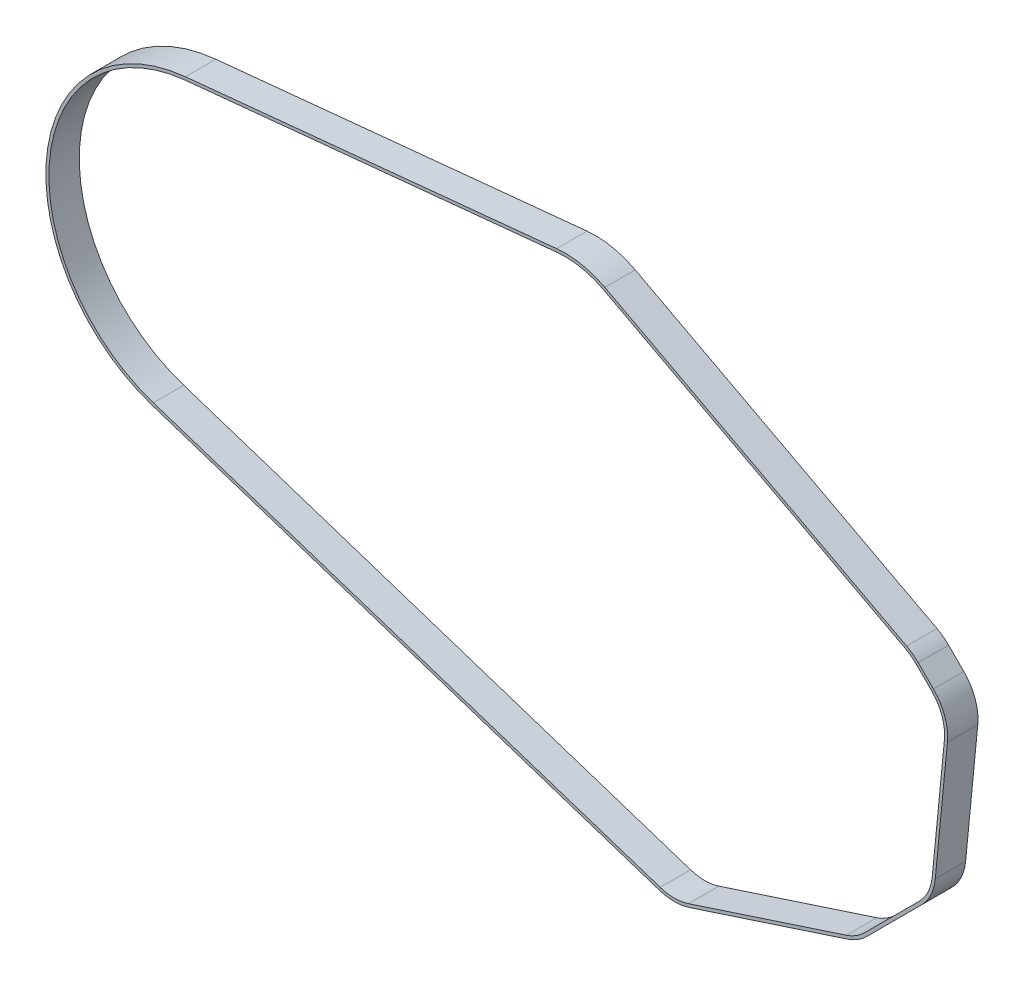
ISO-10303-21;
HEADER;
FILE_DESCRIPTION(('STEP AP214'),'2;1');
FILE_NAME('part.step','',(''),(''),'','','');
FILE_SCHEMA(('AUTOMOTIVE_DESIGN { 1 0 10303 214 1 1 1 1 }'));
ENDSEC;
DATA;
#1=APPLICATION_CONTEXT('core data for automotive mechanical design processes');
#2=APPLICATION_PROTOCOL_DEFINITION('international standard','automotive_design',2000,#1);
#3=PRODUCT_CONTEXT('',#1,'mechanical');
#4=PRODUCT('Part','Part','',(#3));
#5=PRODUCT_RELATED_PRODUCT_CATEGORY('part','',(#4));
#6=PRODUCT_DEFINITION_FORMATION('','',#4);
#7=PRODUCT_DEFINITION_CONTEXT('part definition',#1,'design');
#8=PRODUCT_DEFINITION('design','',#6,#7);
#9=PRODUCT_DEFINITION_SHAPE('','',#8);
#10=(LENGTH_UNIT() NAMED_UNIT(*) SI_UNIT(.MILLI.,.METRE.));
#11=(NAMED_UNIT(*) PLANE_ANGLE_UNIT() SI_UNIT($,.RADIAN.));
#12=(NAMED_UNIT(*) SI_UNIT($,.STERADIAN.) SOLID_ANGLE_UNIT());
#13=UNCERTAINTY_MEASURE_WITH_UNIT(LENGTH_MEASURE(1.E-05),#10,'distance_accuracy_value','');
#14=(GEOMETRIC_REPRESENTATION_CONTEXT(3) GLOBAL_UNCERTAINTY_ASSIGNED_CONTEXT((#13)) GLOBAL_UNIT_ASSIGNED_CONTEXT((#10,
#11,#12)) REPRESENTATION_CONTEXT('',''));
#15=CARTESIAN_POINT('',(0.,0.,0.));
#16=DIRECTION('',(0.,0.,1.));
#17=DIRECTION('',(1.,0.,0.));
#18=AXIS2_PLACEMENT_3D('',#15,#16,#17);
#19=CARTESIAN_POINT('',(0.,0.,-10.));
#20=DIRECTION('',(0.,0.,1.));
#21=DIRECTION('',(1.,0.,0.));
#22=AXIS2_PLACEMENT_3D('',#19,#20,#21);
#23=CYLINDRICAL_SURFACE('',#22,51.);
#24=CARTESIAN_POINT('',(0.,0.,0.));
#25=DIRECTION('',(0.,0.,1.));
#26=DIRECTION('',(1.,0.,0.));
#27=AXIS2_PLACEMENT_3D('',#24,#25,#26);
#28=CIRCLE('',#27,51.);
#29=CARTESIAN_POINT('',(-5.02754675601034,50.7515888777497,0.));
#30=VERTEX_POINT('',#29);
#31=CARTESIAN_POINT('',(-15.8941315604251,-48.4600514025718,0.));
#32=VERTEX_POINT('',#31);
#33=EDGE_CURVE('E311',#30,#32,#28,.T.);
#34=ORIENTED_EDGE('',*,*,#33,.F.);
#35=DIRECTION('',(0.,0.,1.));
#36=VECTOR('',#35,1.);
#37=CARTESIAN_POINT('',(-5.02754675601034,50.7515888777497,-10.));
#38=LINE('',#37,#36);
#39=CARTESIAN_POINT('',(-5.02754675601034,50.7515888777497,-10.));
#40=VERTEX_POINT('',#39);
#41=EDGE_CURVE('E11',#40,#30,#38,.T.);
#42=ORIENTED_EDGE('',*,*,#41,.F.);
#43=CARTESIAN_POINT('',(0.,0.,-10.));
#44=DIRECTION('',(0.,0.,1.));
#45=DIRECTION('',(1.,0.,0.));
#46=AXIS2_PLACEMENT_3D('',#43,#44,#45);
#47=CIRCLE('',#46,51.);
#48=CARTESIAN_POINT('',(-15.8941315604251,-48.4600514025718,-10.));
#49=VERTEX_POINT('',#48);
#50=EDGE_CURVE('E375',#40,#49,#47,.T.);
#51=ORIENTED_EDGE('',*,*,#50,.T.);
#52=DIRECTION('',(0.,0.,1.));
#53=VECTOR('',#52,1.);
#54=CARTESIAN_POINT('',(-15.8941315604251,-48.4600514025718,-10.));
#55=LINE('',#54,#53);
#56=EDGE_CURVE('E34',#49,#32,#55,.T.);
#57=ORIENTED_EDGE('',*,*,#56,.T.);
#58=EDGE_LOOP('',(#34,#42,#51,#57));
#59=FACE_BOUND('',#58,.T.);
#60=ADVANCED_FACE('F31',(#59),#23,.T.);
#61=CARTESIAN_POINT('',(-5.02754675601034,50.7515888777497,-10.));
#62=DIRECTION('',(-0.0985793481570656,0.995129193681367,0.));
#63=DIRECTION('',(-0.995129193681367,-0.0985793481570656,0.));
#64=AXIS2_PLACEMENT_3D('',#61,#62,#63);
#65=PLANE('',#64);
#66=DIRECTION('',(-0.995129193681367,-0.0985793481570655,0.));
#67=VECTOR('',#66,1.);
#68=CARTESIAN_POINT('',(-5.02754675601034,50.7515888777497,0.));
#69=LINE('',#68,#67);
#70=CARTESIAN_POINT('',(117.239778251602,62.8636174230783,0.));
#71=VERTEX_POINT('',#70);
#72=EDGE_CURVE('E372',#71,#30,#69,.T.);
#73=ORIENTED_EDGE('',*,*,#72,.F.);
#74=DIRECTION('',(0.,0.,1.));
#75=VECTOR('',#74,1.);
#76=CARTESIAN_POINT('',(117.239778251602,62.8636174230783,-10.));
#77=LINE('',#76,#75);
#78=CARTESIAN_POINT('',(117.239778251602,62.8636174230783,-10.));
#79=VERTEX_POINT('',#78);
#80=EDGE_CURVE('E39',#79,#71,#77,.T.);
#81=ORIENTED_EDGE('',*,*,#80,.F.);
#82=DIRECTION('',(-0.995129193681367,-0.0985793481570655,0.));
#83=VECTOR('',#82,1.);
#84=CARTESIAN_POINT('',(-5.02754675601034,50.7515888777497,-10.));
#85=LINE('',#84,#83);
#86=EDGE_CURVE('E414',#79,#40,#85,.T.);
#87=ORIENTED_EDGE('',*,*,#86,.T.);
#88=ORIENTED_EDGE('',*,*,#41,.T.);
#89=EDGE_LOOP('',(#73,#81,#87,#88));
#90=FACE_BOUND('',#89,.T.);
#91=ADVANCED_FACE('F449',(#90),#65,.T.);
#92=CARTESIAN_POINT('',(120.,35.,-10.));
#93=DIRECTION('',(0.,0.,1.));
#94=DIRECTION('',(1.,0.,0.));
#95=AXIS2_PLACEMENT_3D('',#92,#93,#94);
#96=CYLINDRICAL_SURFACE('',#95,28.);
#97=CARTESIAN_POINT('',(120.,35.,0.));
#98=DIRECTION('',(0.,0.,1.));
#99=DIRECTION('',(1.,0.,0.));
#100=AXIS2_PLACEMENT_3D('',#97,#98,#99);
#101=CIRCLE('',#100,28.);
#102=CARTESIAN_POINT('',(133.098849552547,59.7471238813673,0.));
#103=VERTEX_POINT('',#102);
#104=EDGE_CURVE('E369',#103,#71,#101,.T.);
#105=ORIENTED_EDGE('',*,*,#104,.F.);
#106=DIRECTION('',(0.,0.,1.));
#107=VECTOR('',#106,1.);
#108=CARTESIAN_POINT('',(133.098849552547,59.7471238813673,-10.));
#109=LINE('',#108,#107);
#110=CARTESIAN_POINT('',(133.098849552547,59.7471238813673,-10.));
#111=VERTEX_POINT('',#110);
#112=EDGE_CURVE('E418',#111,#103,#109,.T.);
#113=ORIENTED_EDGE('',*,*,#112,.F.);
#114=CARTESIAN_POINT('',(120.,35.,-10.));
#115=DIRECTION('',(0.,0.,1.));
#116=DIRECTION('',(1.,0.,0.));
#117=AXIS2_PLACEMENT_3D('',#114,#115,#116);
#118=CIRCLE('',#117,28.);
#119=EDGE_CURVE('E411',#111,#79,#118,.T.);
#120=ORIENTED_EDGE('',*,*,#119,.T.);
#121=ORIENTED_EDGE('',*,*,#80,.T.);
#122=EDGE_LOOP('',(#105,#113,#120,#121));
#123=FACE_BOUND('',#122,.T.);
#124=ADVANCED_FACE('F494',(#123),#96,.T.);
#125=CARTESIAN_POINT('',(133.098849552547,59.7471238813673,-10.));
#126=DIRECTION('',(0.467816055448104,0.883825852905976,0.));
#127=DIRECTION('',(-0.883825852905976,0.467816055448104,0.));
#128=AXIS2_PLACEMENT_3D('',#125,#126,#127);
#129=PLANE('',#128);
#130=DIRECTION('',(-0.883825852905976,0.467816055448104,0.));
#131=VECTOR('',#130,1.);
#132=CARTESIAN_POINT('',(133.098849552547,59.7471238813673,0.));
#133=LINE('',#132,#131);
#134=CARTESIAN_POINT('',(232.48505688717,7.14121364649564,0.));
#135=VERTEX_POINT('',#134);
#136=EDGE_CURVE('E366',#135,#103,#133,.T.);
#137=ORIENTED_EDGE('',*,*,#136,.F.);
#138=DIRECTION('',(0.,0.,1.));
#139=VECTOR('',#138,1.);
#140=CARTESIAN_POINT('',(232.48505688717,7.14121364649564,-10.));
#141=LINE('',#140,#139);
#142=CARTESIAN_POINT('',(232.48505688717,7.14121364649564,-10.));
#143=VERTEX_POINT('',#142);
#144=EDGE_CURVE('E420',#143,#135,#141,.T.);
#145=ORIENTED_EDGE('',*,*,#144,.F.);
#146=DIRECTION('',(-0.883825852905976,0.467816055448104,0.));
#147=VECTOR('',#146,1.);
#148=CARTESIAN_POINT('',(133.098849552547,59.7471238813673,-10.));
#149=LINE('',#148,#147);
#150=EDGE_CURVE('E408',#143,#111,#149,.T.);
#151=ORIENTED_EDGE('',*,*,#150,.T.);
#152=ORIENTED_EDGE('',*,*,#112,.T.);
#153=EDGE_LOOP('',(#137,#145,#151,#152));
#154=FACE_BOUND('',#153,.T.);
#155=ADVANCED_FACE('F492',(#154),#129,.T.);
#156=CARTESIAN_POINT('',(225.,-7.,-10.));
#157=DIRECTION('',(0.,0.,1.));
#158=DIRECTION('',(1.,0.,0.));
#159=AXIS2_PLACEMENT_3D('',#156,#157,#158);
#160=CYLINDRICAL_SURFACE('',#159,16.);
#161=CARTESIAN_POINT('',(225.,-7.,0.));
#162=DIRECTION('',(0.,0.,1.));
#163=DIRECTION('',(1.,0.,0.));
#164=AXIS2_PLACEMENT_3D('',#161,#162,#163);
#165=CIRCLE('',#164,16.);
#166=CARTESIAN_POINT('',(236.313708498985,4.31370849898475,0.));
#167=VERTEX_POINT('',#166);
#168=EDGE_CURVE('E363',#167,#135,#165,.T.);
#169=ORIENTED_EDGE('',*,*,#168,.F.);
#170=DIRECTION('',(0.,0.,1.));
#171=VECTOR('',#170,1.);
#172=CARTESIAN_POINT('',(236.313708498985,4.31370849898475,-10.));
#173=LINE('',#172,#171);
#174=CARTESIAN_POINT('',(236.313708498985,4.31370849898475,-10.));
#175=VERTEX_POINT('',#174);
#176=EDGE_CURVE('E422',#175,#167,#173,.T.);
#177=ORIENTED_EDGE('',*,*,#176,.F.);
#178=CARTESIAN_POINT('',(225.,-7.,-10.));
#179=DIRECTION('',(0.,0.,1.));
#180=DIRECTION('',(1.,0.,0.));
#181=AXIS2_PLACEMENT_3D('',#178,#179,#180);
#182=CIRCLE('',#181,16.);
#183=EDGE_CURVE('E405',#175,#143,#182,.T.);
#184=ORIENTED_EDGE('',*,*,#183,.T.);
#185=ORIENTED_EDGE('',*,*,#144,.T.);
#186=EDGE_LOOP('',(#169,#177,#184,#185));
#187=FACE_BOUND('',#186,.T.);
#188=ADVANCED_FACE('F488',(#187),#160,.T.);
#189=CARTESIAN_POINT('',(236.313708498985,4.31370849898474,-10.));
#190=DIRECTION('',(0.707106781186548,0.707106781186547,0.));
#191=DIRECTION('',(-0.707106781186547,0.707106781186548,0.));
#192=AXIS2_PLACEMENT_3D('',#189,#190,#191);
#193=PLANE('',#192);
#194=DIRECTION('',(-0.707106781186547,0.707106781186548,0.));
#195=VECTOR('',#194,1.);
#196=CARTESIAN_POINT('',(236.313708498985,4.31370849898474,0.));
#197=LINE('',#196,#195);
#198=CARTESIAN_POINT('',(241.313708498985,-0.686291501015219,0.));
#199=VERTEX_POINT('',#198);
#200=EDGE_CURVE('E360',#199,#167,#197,.T.);
#201=ORIENTED_EDGE('',*,*,#200,.F.);
#202=DIRECTION('',(0.,0.,1.));
#203=VECTOR('',#202,1.);
#204=CARTESIAN_POINT('',(241.313708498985,-0.686291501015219,-10.));
#205=LINE('',#204,#203);
#206=CARTESIAN_POINT('',(241.313708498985,-0.686291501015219,-10.));
#207=VERTEX_POINT('',#206);
#208=EDGE_CURVE('E424',#207,#199,#205,.T.);
#209=ORIENTED_EDGE('',*,*,#208,.F.);
#210=DIRECTION('',(-0.707106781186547,0.707106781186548,0.));
#211=VECTOR('',#210,1.);
#212=CARTESIAN_POINT('',(236.313708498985,4.31370849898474,-10.));
#213=LINE('',#212,#211);
#214=EDGE_CURVE('E402',#207,#175,#213,.T.);
#215=ORIENTED_EDGE('',*,*,#214,.T.);
#216=ORIENTED_EDGE('',*,*,#176,.T.);
#217=EDGE_LOOP('',(#201,#209,#215,#216));
#218=FACE_BOUND('',#217,.T.);
#219=ADVANCED_FACE('F484',(#218),#193,.T.);
#220=CARTESIAN_POINT('',(230.,-12.,-10.));
#221=DIRECTION('',(0.,0.,1.));
#222=DIRECTION('',(1.,0.,0.));
#223=AXIS2_PLACEMENT_3D('',#220,#221,#222);
#224=CYLINDRICAL_SURFACE('',#223,16.);
#225=CARTESIAN_POINT('',(230.,-12.,0.));
#226=DIRECTION('',(0.,0.,1.));
#227=DIRECTION('',(1.,0.,0.));
#228=AXIS2_PLACEMENT_3D('',#225,#226,#227);
#229=CIRCLE('',#228,16.);
#230=CARTESIAN_POINT('',(245.92439414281,-13.5535994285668,0.));
#231=VERTEX_POINT('',#230);
#232=EDGE_CURVE('E357',#231,#199,#229,.T.);
#233=ORIENTED_EDGE('',*,*,#232,.F.);
#234=DIRECTION('',(0.,0.,1.));
#235=VECTOR('',#234,1.);
#236=CARTESIAN_POINT('',(245.92439414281,-13.5535994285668,-10.));
#237=LINE('',#236,#235);
#238=CARTESIAN_POINT('',(245.92439414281,-13.5535994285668,-10.));
#239=VERTEX_POINT('',#238);
#240=EDGE_CURVE('E426',#239,#231,#237,.T.);
#241=ORIENTED_EDGE('',*,*,#240,.F.);
#242=CARTESIAN_POINT('',(230.,-12.,-10.));
#243=DIRECTION('',(0.,0.,1.));
#244=DIRECTION('',(1.,0.,0.));
#245=AXIS2_PLACEMENT_3D('',#242,#243,#244);
#246=CIRCLE('',#245,16.);
#247=EDGE_CURVE('E399',#239,#207,#246,.T.);
#248=ORIENTED_EDGE('',*,*,#247,.T.);
#249=ORIENTED_EDGE('',*,*,#208,.T.);
#250=EDGE_LOOP('',(#233,#241,#248,#249));
#251=FACE_BOUND('',#250,.T.);
#252=ADVANCED_FACE('F480',(#251),#224,.T.);
#253=CARTESIAN_POINT('',(245.92439414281,-13.5535994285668,-10.));
#254=DIRECTION('',(0.995274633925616,-0.0970999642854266,0.));
#255=DIRECTION('',(0.0970999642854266,0.995274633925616,0.));
#256=AXIS2_PLACEMENT_3D('',#253,#254,#255);
#257=PLANE('',#256);
#258=DIRECTION('',(0.0970999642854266,0.995274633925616,0.));
#259=VECTOR('',#258,1.);
#260=CARTESIAN_POINT('',(245.92439414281,-13.5535994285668,0.));
#261=LINE('',#260,#259);
#262=CARTESIAN_POINT('',(241.92439414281,-54.5535994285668,0.));
#263=VERTEX_POINT('',#262);
#264=EDGE_CURVE('E354',#263,#231,#261,.T.);
#265=ORIENTED_EDGE('',*,*,#264,.F.);
#266=DIRECTION('',(0.,0.,1.));
#267=VECTOR('',#266,1.);
#268=CARTESIAN_POINT('',(241.92439414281,-54.5535994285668,-10.));
#269=LINE('',#268,#267);
#270=CARTESIAN_POINT('',(241.92439414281,-54.5535994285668,-10.));
#271=VERTEX_POINT('',#270);
#272=EDGE_CURVE('E428',#271,#263,#269,.T.);
#273=ORIENTED_EDGE('',*,*,#272,.F.);
#274=DIRECTION('',(0.0970999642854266,0.995274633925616,0.));
#275=VECTOR('',#274,1.);
#276=CARTESIAN_POINT('',(245.92439414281,-13.5535994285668,-10.));
#277=LINE('',#276,#275);
#278=EDGE_CURVE('E396',#271,#239,#277,.T.);
#279=ORIENTED_EDGE('',*,*,#278,.T.);
#280=ORIENTED_EDGE('',*,*,#240,.T.);
#281=EDGE_LOOP('',(#265,#273,#279,#280));
#282=FACE_BOUND('',#281,.T.);
#283=ADVANCED_FACE('F476',(#282),#257,.T.);
#284=CARTESIAN_POINT('',(226.,-53.,-10.));
#285=DIRECTION('',(0.,0.,1.));
#286=DIRECTION('',(1.,0.,0.));
#287=AXIS2_PLACEMENT_3D('',#284,#285,#286);
#288=CYLINDRICAL_SURFACE('',#287,16.);
#289=CARTESIAN_POINT('',(226.,-53.,0.));
#290=DIRECTION('',(0.,0.,1.));
#291=DIRECTION('',(1.,0.,0.));
#292=AXIS2_PLACEMENT_3D('',#289,#290,#291);
#293=CIRCLE('',#292,16.);
#294=CARTESIAN_POINT('',(237.313708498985,-64.3137084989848,0.));
#295=VERTEX_POINT('',#294);
#296=EDGE_CURVE('E351',#295,#263,#293,.T.);
#297=ORIENTED_EDGE('',*,*,#296,.F.);
#298=DIRECTION('',(0.,0.,1.));
#299=VECTOR('',#298,1.);
#300=CARTESIAN_POINT('',(237.313708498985,-64.3137084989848,-10.));
#301=LINE('',#300,#299);
#302=CARTESIAN_POINT('',(237.313708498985,-64.3137084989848,-10.));
#303=VERTEX_POINT('',#302);
#304=EDGE_CURVE('E430',#303,#295,#301,.T.);
#305=ORIENTED_EDGE('',*,*,#304,.F.);
#306=CARTESIAN_POINT('',(226.,-53.,-10.));
#307=DIRECTION('',(0.,0.,1.));
#308=DIRECTION('',(1.,0.,0.));
#309=AXIS2_PLACEMENT_3D('',#306,#307,#308);
#310=CIRCLE('',#309,16.);
#311=EDGE_CURVE('E393',#303,#271,#310,.T.);
#312=ORIENTED_EDGE('',*,*,#311,.T.);
#313=ORIENTED_EDGE('',*,*,#272,.T.);
#314=EDGE_LOOP('',(#297,#305,#312,#313));
#315=FACE_BOUND('',#314,.T.);
#316=ADVANCED_FACE('F472',(#315),#288,.T.);
#317=CARTESIAN_POINT('',(237.313708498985,-64.3137084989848,-10.));
#318=DIRECTION('',(0.707106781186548,-0.707106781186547,0.));
#319=DIRECTION('',(0.707106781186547,0.707106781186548,0.));
#320=AXIS2_PLACEMENT_3D('',#317,#318,#319);
#321=PLANE('',#320);
#322=DIRECTION('',(0.707106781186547,0.707106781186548,0.));
#323=VECTOR('',#322,1.);
#324=CARTESIAN_POINT('',(237.313708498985,-64.3137084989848,0.));
#325=LINE('',#324,#323);
#326=CARTESIAN_POINT('',(219.313708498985,-82.3137084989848,0.));
#327=VERTEX_POINT('',#326);
#328=EDGE_CURVE('E348',#327,#295,#325,.T.);
#329=ORIENTED_EDGE('',*,*,#328,.F.);
#330=DIRECTION('',(0.,0.,1.));
#331=VECTOR('',#330,1.);
#332=CARTESIAN_POINT('',(219.313708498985,-82.3137084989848,-10.));
#333=LINE('',#332,#331);
#334=CARTESIAN_POINT('',(219.313708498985,-82.3137084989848,-10.));
#335=VERTEX_POINT('',#334);
#336=EDGE_CURVE('E432',#335,#327,#333,.T.);
#337=ORIENTED_EDGE('',*,*,#336,.F.);
#338=DIRECTION('',(0.707106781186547,0.707106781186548,0.));
#339=VECTOR('',#338,1.);
#340=CARTESIAN_POINT('',(237.313708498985,-64.3137084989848,-10.));
#341=LINE('',#340,#339);
#342=EDGE_CURVE('E390',#335,#303,#341,.T.);
#343=ORIENTED_EDGE('',*,*,#342,.T.);
#344=ORIENTED_EDGE('',*,*,#304,.T.);
#345=EDGE_LOOP('',(#329,#337,#343,#344));
#346=FACE_BOUND('',#345,.T.);
#347=ADVANCED_FACE('F468',(#346),#321,.T.);
#348=CARTESIAN_POINT('',(208.,-71.,-10.));
#349=DIRECTION('',(0.,0.,1.));
#350=DIRECTION('',(1.,0.,0.));
#351=AXIS2_PLACEMENT_3D('',#348,#349,#350);
#352=CYLINDRICAL_SURFACE('',#351,16.);
#353=CARTESIAN_POINT('',(208.,-71.,0.));
#354=DIRECTION('',(0.,0.,1.));
#355=DIRECTION('',(1.,0.,0.));
#356=AXIS2_PLACEMENT_3D('',#353,#354,#355);
#357=CIRCLE('',#356,16.);
#358=CARTESIAN_POINT('',(212.971821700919,-86.2079252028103,0.));
#359=VERTEX_POINT('',#358);
#360=EDGE_CURVE('E345',#359,#327,#357,.T.);
#361=ORIENTED_EDGE('',*,*,#360,.F.);
#362=DIRECTION('',(0.,0.,1.));
#363=VECTOR('',#362,1.);
#364=CARTESIAN_POINT('',(212.971821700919,-86.2079252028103,-10.));
#365=LINE('',#364,#363);
#366=CARTESIAN_POINT('',(212.971821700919,-86.2079252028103,-10.));
#367=VERTEX_POINT('',#366);
#368=EDGE_CURVE('E434',#367,#359,#365,.T.);
#369=ORIENTED_EDGE('',*,*,#368,.F.);
#370=CARTESIAN_POINT('',(208.,-71.,-10.));
#371=DIRECTION('',(0.,0.,1.));
#372=DIRECTION('',(1.,0.,0.));
#373=AXIS2_PLACEMENT_3D('',#370,#371,#372);
#374=CIRCLE('',#373,16.);
#375=EDGE_CURVE('E387',#367,#335,#374,.T.);
#376=ORIENTED_EDGE('',*,*,#375,.T.);
#377=ORIENTED_EDGE('',*,*,#336,.T.);
#378=EDGE_LOOP('',(#361,#369,#376,#377));
#379=FACE_BOUND('',#378,.T.);
#380=ADVANCED_FACE('F464',(#379),#352,.T.);
#381=CARTESIAN_POINT('',(212.971821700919,-86.2079252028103,-10.));
#382=DIRECTION('',(0.310738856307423,-0.950495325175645,0.));
#383=DIRECTION('',(0.950495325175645,0.310738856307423,0.));
#384=AXIS2_PLACEMENT_3D('',#381,#382,#383);
#385=PLANE('',#384);
#386=DIRECTION('',(0.950495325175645,0.310738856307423,0.));
#387=VECTOR('',#386,1.);
#388=CARTESIAN_POINT('',(212.971821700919,-86.2079252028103,0.));
#389=LINE('',#388,#387);
#390=CARTESIAN_POINT('',(160.971821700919,-103.20792520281,0.));
#391=VERTEX_POINT('',#390);
#392=EDGE_CURVE('E342',#391,#359,#389,.T.);
#393=ORIENTED_EDGE('',*,*,#392,.F.);
#394=DIRECTION('',(0.,0.,1.));
#395=VECTOR('',#394,1.);
#396=CARTESIAN_POINT('',(160.971821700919,-103.20792520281,-10.));
#397=LINE('',#396,#395);
#398=CARTESIAN_POINT('',(160.971821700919,-103.20792520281,-10.));
#399=VERTEX_POINT('',#398);
#400=EDGE_CURVE('E436',#399,#391,#397,.T.);
#401=ORIENTED_EDGE('',*,*,#400,.F.);
#402=DIRECTION('',(0.950495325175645,0.310738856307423,0.));
#403=VECTOR('',#402,1.);
#404=CARTESIAN_POINT('',(212.971821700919,-86.2079252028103,-10.));
#405=LINE('',#404,#403);
#406=EDGE_CURVE('E384',#399,#367,#405,.T.);
#407=ORIENTED_EDGE('',*,*,#406,.T.);
#408=ORIENTED_EDGE('',*,*,#368,.T.);
#409=EDGE_LOOP('',(#393,#401,#407,#408));
#410=FACE_BOUND('',#409,.T.);
#411=ADVANCED_FACE('F462',(#410),#385,.T.);
#412=CARTESIAN_POINT('',(156.,-88.,-10.));
#413=DIRECTION('',(0.,0.,1.));
#414=DIRECTION('',(1.,0.,0.));
#415=AXIS2_PLACEMENT_3D('',#412,#413,#414);
#416=CYLINDRICAL_SURFACE('',#415,16.);
#417=CARTESIAN_POINT('',(156.,-88.,0.));
#418=DIRECTION('',(0.,0.,1.));
#419=DIRECTION('',(1.,0.,0.));
#420=AXIS2_PLACEMENT_3D('',#417,#418,#419);
#421=CIRCLE('',#420,16.);
#422=CARTESIAN_POINT('',(151.013605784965,-103.203153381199,0.));
#423=VERTEX_POINT('',#422);
#424=EDGE_CURVE('E339',#423,#391,#421,.T.);
#425=ORIENTED_EDGE('',*,*,#424,.F.);
#426=DIRECTION('',(0.,0.,1.));
#427=VECTOR('',#426,1.);
#428=CARTESIAN_POINT('',(151.013605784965,-103.203153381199,-10.));
#429=LINE('',#428,#427);
#430=CARTESIAN_POINT('',(151.013605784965,-103.203153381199,-10.));
#431=VERTEX_POINT('',#430);
#432=EDGE_CURVE('E437',#431,#423,#429,.T.);
#433=ORIENTED_EDGE('',*,*,#432,.F.);
#434=CARTESIAN_POINT('',(156.,-88.,-10.));
#435=DIRECTION('',(0.,0.,1.));
#436=DIRECTION('',(1.,0.,0.));
#437=AXIS2_PLACEMENT_3D('',#434,#435,#436);
#438=CIRCLE('',#437,16.);
#439=EDGE_CURVE('E381',#431,#399,#438,.T.);
#440=ORIENTED_EDGE('',*,*,#439,.T.);
#441=ORIENTED_EDGE('',*,*,#400,.T.);
#442=EDGE_LOOP('',(#425,#433,#440,#441));
#443=FACE_BOUND('',#442,.T.);
#444=ADVANCED_FACE('F458',(#443),#416,.T.);
#445=CARTESIAN_POINT('',(151.013605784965,-103.203153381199,-10.));
#446=DIRECTION('',(-0.311649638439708,-0.950197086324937,0.));
#447=DIRECTION('',(0.950197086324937,-0.311649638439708,0.));
#448=AXIS2_PLACEMENT_3D('',#445,#446,#447);
#449=PLANE('',#448);
#450=DIRECTION('',(0.950197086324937,-0.311649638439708,0.));
#451=VECTOR('',#450,1.);
#452=CARTESIAN_POINT('',(151.013605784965,-103.203153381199,0.));
#453=LINE('',#452,#451);
#454=EDGE_CURVE('E336',#32,#423,#453,.T.);
#455=ORIENTED_EDGE('',*,*,#454,.F.);
#456=ORIENTED_EDGE('',*,*,#56,.F.);
#457=DIRECTION('',(0.950197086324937,-0.311649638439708,0.));
#458=VECTOR('',#457,1.);
#459=CARTESIAN_POINT('',(151.013605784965,-103.203153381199,-10.));
#460=LINE('',#459,#458);
#461=EDGE_CURVE('E378',#49,#431,#460,.T.);
#462=ORIENTED_EDGE('',*,*,#461,.T.);
#463=ORIENTED_EDGE('',*,*,#432,.T.);
#464=EDGE_LOOP('',(#455,#456,#462,#463));
#465=FACE_BOUND('',#464,.T.);
#466=ADVANCED_FACE('F445',(#465),#449,.T.);
#467=CARTESIAN_POINT('',(0.,0.,-10.));
#468=DIRECTION('',(0.,0.,1.));
#469=DIRECTION('',(1.,0.,0.));
#470=AXIS2_PLACEMENT_3D('',#467,#468,#469);
#471=PLANE('',#470);
#472=DIRECTION('',(-0.995129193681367,-0.0985793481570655,0.));
#473=VECTOR('',#472,1.);
#474=CARTESIAN_POINT('',(-4.92896740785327,49.7564596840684,-10.));
#475=LINE('',#474,#473);
#476=CARTESIAN_POINT('',(117.338357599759,61.8684882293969,-10.));
#477=VERTEX_POINT('',#476);
#478=CARTESIAN_POINT('',(-4.92896740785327,49.7564596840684,-10.));
#479=VERTEX_POINT('',#478);
#480=EDGE_CURVE('E306',#477,#479,#475,.T.);
#481=ORIENTED_EDGE('',*,*,#480,.T.);
#482=CARTESIAN_POINT('',(0.,0.,-10.));
#483=DIRECTION('',(0.,0.,1.));
#484=DIRECTION('',(1.,0.,0.));
#485=AXIS2_PLACEMENT_3D('',#482,#483,#484);
#486=CIRCLE('',#485,50.);
#487=CARTESIAN_POINT('',(-15.5824819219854,-47.5098543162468,-10.));
#488=VERTEX_POINT('',#487);
#489=EDGE_CURVE('E270',#479,#488,#486,.T.);
#490=ORIENTED_EDGE('',*,*,#489,.T.);
#491=DIRECTION('',(0.950197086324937,-0.311649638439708,0.));
#492=VECTOR('',#491,1.);
#493=CARTESIAN_POINT('',(151.325255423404,-102.252956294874,-10.));
#494=LINE('',#493,#492);
#495=CARTESIAN_POINT('',(151.325255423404,-102.252956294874,-10.));
#496=VERTEX_POINT('',#495);
#497=EDGE_CURVE('E273',#488,#496,#494,.T.);
#498=ORIENTED_EDGE('',*,*,#497,.T.);
#499=CARTESIAN_POINT('',(156.,-88.,-10.));
#500=DIRECTION('',(0.,0.,1.));
#501=DIRECTION('',(1.,0.,0.));
#502=AXIS2_PLACEMENT_3D('',#499,#500,#501);
#503=CIRCLE('',#502,15.);
#504=CARTESIAN_POINT('',(160.661082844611,-102.257429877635,-10.));
#505=VERTEX_POINT('',#504);
#506=EDGE_CURVE('E47',#496,#505,#503,.T.);
#507=ORIENTED_EDGE('',*,*,#506,.T.);
#508=DIRECTION('',(0.950495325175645,0.310738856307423,0.));
#509=VECTOR('',#508,1.);
#510=CARTESIAN_POINT('',(212.661082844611,-85.2574298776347,-10.));
#511=LINE('',#510,#509);
#512=CARTESIAN_POINT('',(212.661082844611,-85.2574298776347,-10.));
#513=VERTEX_POINT('',#512);
#514=EDGE_CURVE('E276',#505,#513,#511,.T.);
#515=ORIENTED_EDGE('',*,*,#514,.T.);
#516=CARTESIAN_POINT('',(208.,-71.,-10.));
#517=DIRECTION('',(0.,0.,1.));
#518=DIRECTION('',(1.,0.,0.));
#519=AXIS2_PLACEMENT_3D('',#516,#517,#518);
#520=CIRCLE('',#519,15.);
#521=CARTESIAN_POINT('',(218.606601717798,-81.6066017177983,-10.));
#522=VERTEX_POINT('',#521);
#523=EDGE_CURVE('E279',#513,#522,#520,.T.);
#524=ORIENTED_EDGE('',*,*,#523,.T.);
#525=DIRECTION('',(0.707106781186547,0.707106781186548,0.));
#526=VECTOR('',#525,1.);
#527=CARTESIAN_POINT('',(236.606601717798,-63.6066017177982,-10.));
#528=LINE('',#527,#526);
#529=CARTESIAN_POINT('',(236.606601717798,-63.6066017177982,-10.));
#530=VERTEX_POINT('',#529);
#531=EDGE_CURVE('E282',#522,#530,#528,.T.);
#532=ORIENTED_EDGE('',*,*,#531,.T.);
#533=CARTESIAN_POINT('',(226.,-53.,-10.));
#534=DIRECTION('',(0.,0.,1.));
#535=DIRECTION('',(1.,0.,0.));
#536=AXIS2_PLACEMENT_3D('',#533,#534,#535);
#537=CIRCLE('',#536,15.);
#538=CARTESIAN_POINT('',(240.929119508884,-54.4564994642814,-10.));
#539=VERTEX_POINT('',#538);
#540=EDGE_CURVE('E285',#530,#539,#537,.T.);
#541=ORIENTED_EDGE('',*,*,#540,.T.);
#542=DIRECTION('',(0.0970999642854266,0.995274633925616,0.));
#543=VECTOR('',#542,1.);
#544=CARTESIAN_POINT('',(244.929119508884,-13.4564994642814,-10.));
#545=LINE('',#544,#543);
#546=CARTESIAN_POINT('',(244.929119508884,-13.4564994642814,-10.));
#547=VERTEX_POINT('',#546);
#548=EDGE_CURVE('E288',#539,#547,#545,.T.);
#549=ORIENTED_EDGE('',*,*,#548,.T.);
#550=CARTESIAN_POINT('',(230.,-12.,-10.));
#551=DIRECTION('',(0.,0.,1.));
#552=DIRECTION('',(1.,0.,0.));
#553=AXIS2_PLACEMENT_3D('',#550,#551,#552);
#554=CIRCLE('',#553,15.);
#555=CARTESIAN_POINT('',(240.606601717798,-1.39339828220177,-10.));
#556=VERTEX_POINT('',#555);
#557=EDGE_CURVE('E291',#547,#556,#554,.T.);
#558=ORIENTED_EDGE('',*,*,#557,.T.);
#559=DIRECTION('',(-0.707106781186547,0.707106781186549,0.));
#560=VECTOR('',#559,1.);
#561=CARTESIAN_POINT('',(235.606601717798,3.60660171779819,-10.));
#562=LINE('',#561,#560);
#563=CARTESIAN_POINT('',(235.606601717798,3.6066017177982,-10.));
#564=VERTEX_POINT('',#563);
#565=EDGE_CURVE('E294',#556,#564,#562,.T.);
#566=ORIENTED_EDGE('',*,*,#565,.T.);
#567=CARTESIAN_POINT('',(225.,-7.,-10.));
#568=DIRECTION('',(0.,0.,1.));
#569=DIRECTION('',(1.,0.,0.));
#570=AXIS2_PLACEMENT_3D('',#567,#568,#569);
#571=CIRCLE('',#570,15.);
#572=CARTESIAN_POINT('',(232.017240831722,6.25738779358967,-10.));
#573=VERTEX_POINT('',#572);
#574=EDGE_CURVE('E297',#564,#573,#571,.T.);
#575=ORIENTED_EDGE('',*,*,#574,.T.);
#576=DIRECTION('',(-0.883825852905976,0.467816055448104,0.));
#577=VECTOR('',#576,1.);
#578=CARTESIAN_POINT('',(132.631033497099,58.8632980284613,-10.));
#579=LINE('',#578,#577);
#580=CARTESIAN_POINT('',(132.631033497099,58.8632980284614,-10.));
#581=VERTEX_POINT('',#580);
#582=EDGE_CURVE('E300',#573,#581,#579,.T.);
#583=ORIENTED_EDGE('',*,*,#582,.T.);
#584=CARTESIAN_POINT('',(120.,35.,-10.));
#585=DIRECTION('',(0.,0.,1.));
#586=DIRECTION('',(1.,0.,0.));
#587=AXIS2_PLACEMENT_3D('',#584,#585,#586);
#588=CIRCLE('',#587,27.);
#589=EDGE_CURVE('E303',#581,#477,#588,.T.);
#590=ORIENTED_EDGE('',*,*,#589,.T.);
#591=EDGE_LOOP('',(#481,#490,#498,#507,#515,#524,#532,#541,#549,#558,#566,#575,#583,#590));
#592=FACE_BOUND('',#591,.T.);
#593=ORIENTED_EDGE('',*,*,#50,.F.);
#594=ORIENTED_EDGE('',*,*,#86,.F.);
#595=ORIENTED_EDGE('',*,*,#119,.F.);
#596=ORIENTED_EDGE('',*,*,#150,.F.);
#597=ORIENTED_EDGE('',*,*,#183,.F.);
#598=ORIENTED_EDGE('',*,*,#214,.F.);
#599=ORIENTED_EDGE('',*,*,#247,.F.);
#600=ORIENTED_EDGE('',*,*,#278,.F.);
#601=ORIENTED_EDGE('',*,*,#311,.F.);
#602=ORIENTED_EDGE('',*,*,#342,.F.);
#603=ORIENTED_EDGE('',*,*,#375,.F.);
#604=ORIENTED_EDGE('',*,*,#406,.F.);
#605=ORIENTED_EDGE('',*,*,#439,.F.);
#606=ORIENTED_EDGE('',*,*,#461,.F.);
#607=EDGE_LOOP('',(#593,#594,#595,#596,#597,#598,#599,#600,#601,#602,#603,#604,#605,#606));
#608=FACE_BOUND('',#607,.T.);
#609=ADVANCED_FACE('F452',(#592,#608),#471,.F.);
#610=CARTESIAN_POINT('',(0.,0.,0.));
#611=DIRECTION('',(0.,0.,1.));
#612=DIRECTION('',(1.,0.,0.));
#613=AXIS2_PLACEMENT_3D('',#610,#611,#612);
#614=PLANE('',#613);
#615=CARTESIAN_POINT('',(0.,0.,0.));
#616=DIRECTION('',(0.,0.,1.));
#617=DIRECTION('',(1.,0.,0.));
#618=AXIS2_PLACEMENT_3D('',#615,#616,#617);
#619=CIRCLE('',#618,50.);
#620=CARTESIAN_POINT('',(-4.92896740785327,49.7564596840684,0.));
#621=VERTEX_POINT('',#620);
#622=CARTESIAN_POINT('',(-15.5824819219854,-47.5098543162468,0.));
#623=VERTEX_POINT('',#622);
#624=EDGE_CURVE('E55',#621,#623,#619,.T.);
#625=ORIENTED_EDGE('',*,*,#624,.F.);
#626=DIRECTION('',(-0.995129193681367,-0.0985793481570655,0.));
#627=VECTOR('',#626,1.);
#628=CARTESIAN_POINT('',(-4.92896740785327,49.7564596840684,0.));
#629=LINE('',#628,#627);
#630=CARTESIAN_POINT('',(117.338357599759,61.8684882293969,0.));
#631=VERTEX_POINT('',#630);
#632=EDGE_CURVE('E267',#631,#621,#629,.T.);
#633=ORIENTED_EDGE('',*,*,#632,.F.);
#634=CARTESIAN_POINT('',(120.,35.,0.));
#635=DIRECTION('',(0.,0.,1.));
#636=DIRECTION('',(1.,0.,0.));
#637=AXIS2_PLACEMENT_3D('',#634,#635,#636);
#638=CIRCLE('',#637,27.);
#639=CARTESIAN_POINT('',(132.631033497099,58.8632980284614,0.));
#640=VERTEX_POINT('',#639);
#641=EDGE_CURVE('E264',#640,#631,#638,.T.);
#642=ORIENTED_EDGE('',*,*,#641,.F.);
#643=DIRECTION('',(-0.883825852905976,0.467816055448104,0.));
#644=VECTOR('',#643,1.);
#645=CARTESIAN_POINT('',(132.631033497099,58.8632980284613,0.));
#646=LINE('',#645,#644);
#647=CARTESIAN_POINT('',(232.017240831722,6.25738779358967,0.));
#648=VERTEX_POINT('',#647);
#649=EDGE_CURVE('E261',#648,#640,#646,.T.);
#650=ORIENTED_EDGE('',*,*,#649,.F.);
#651=CARTESIAN_POINT('',(225.,-7.,0.));
#652=DIRECTION('',(0.,0.,1.));
#653=DIRECTION('',(1.,0.,0.));
#654=AXIS2_PLACEMENT_3D('',#651,#652,#653);
#655=CIRCLE('',#654,15.);
#656=CARTESIAN_POINT('',(235.606601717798,3.6066017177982,0.));
#657=VERTEX_POINT('',#656);
#658=EDGE_CURVE('E258',#657,#648,#655,.T.);
#659=ORIENTED_EDGE('',*,*,#658,.F.);
#660=DIRECTION('',(-0.707106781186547,0.707106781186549,0.));
#661=VECTOR('',#660,1.);
#662=CARTESIAN_POINT('',(235.606601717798,3.60660171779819,0.));
#663=LINE('',#662,#661);
#664=CARTESIAN_POINT('',(240.606601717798,-1.39339828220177,0.));
#665=VERTEX_POINT('',#664);
#666=EDGE_CURVE('E255',#665,#657,#663,.T.);
#667=ORIENTED_EDGE('',*,*,#666,.F.);
#668=CARTESIAN_POINT('',(230.,-12.,0.));
#669=DIRECTION('',(0.,0.,1.));
#670=DIRECTION('',(1.,0.,0.));
#671=AXIS2_PLACEMENT_3D('',#668,#669,#670);
#672=CIRCLE('',#671,15.);
#673=CARTESIAN_POINT('',(244.929119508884,-13.4564994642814,0.));
#674=VERTEX_POINT('',#673);
#675=EDGE_CURVE('E252',#674,#665,#672,.T.);
#676=ORIENTED_EDGE('',*,*,#675,.F.);
#677=DIRECTION('',(0.0970999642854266,0.995274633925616,0.));
#678=VECTOR('',#677,1.);
#679=CARTESIAN_POINT('',(244.929119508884,-13.4564994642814,0.));
#680=LINE('',#679,#678);
#681=CARTESIAN_POINT('',(240.929119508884,-54.4564994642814,0.));
#682=VERTEX_POINT('',#681);
#683=EDGE_CURVE('E249',#682,#674,#680,.T.);
#684=ORIENTED_EDGE('',*,*,#683,.F.);
#685=CARTESIAN_POINT('',(226.,-53.,0.));
#686=DIRECTION('',(0.,0.,1.));
#687=DIRECTION('',(1.,0.,0.));
#688=AXIS2_PLACEMENT_3D('',#685,#686,#687);
#689=CIRCLE('',#688,15.);
#690=CARTESIAN_POINT('',(236.606601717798,-63.6066017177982,0.));
#691=VERTEX_POINT('',#690);
#692=EDGE_CURVE('E246',#691,#682,#689,.T.);
#693=ORIENTED_EDGE('',*,*,#692,.F.);
#694=DIRECTION('',(0.707106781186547,0.707106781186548,0.));
#695=VECTOR('',#694,1.);
#696=CARTESIAN_POINT('',(236.606601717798,-63.6066017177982,0.));
#697=LINE('',#696,#695);
#698=CARTESIAN_POINT('',(218.606601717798,-81.6066017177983,0.));
#699=VERTEX_POINT('',#698);
#700=EDGE_CURVE('E243',#699,#691,#697,.T.);
#701=ORIENTED_EDGE('',*,*,#700,.F.);
#702=CARTESIAN_POINT('',(208.,-71.,0.));
#703=DIRECTION('',(0.,0.,1.));
#704=DIRECTION('',(1.,0.,0.));
#705=AXIS2_PLACEMENT_3D('',#702,#703,#704);
#706=CIRCLE('',#705,15.);
#707=CARTESIAN_POINT('',(212.661082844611,-85.2574298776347,0.));
#708=VERTEX_POINT('',#707);
#709=EDGE_CURVE('E237',#708,#699,#706,.T.);
#710=ORIENTED_EDGE('',*,*,#709,.F.);
#711=DIRECTION('',(0.950495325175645,0.310738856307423,0.));
#712=VECTOR('',#711,1.);
#713=CARTESIAN_POINT('',(212.661082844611,-85.2574298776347,0.));
#714=LINE('',#713,#712);
#715=CARTESIAN_POINT('',(160.661082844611,-102.257429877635,0.));
#716=VERTEX_POINT('',#715);
#717=EDGE_CURVE('E235',#716,#708,#714,.T.);
#718=ORIENTED_EDGE('',*,*,#717,.F.);
#719=CARTESIAN_POINT('',(156.,-88.,0.));
#720=DIRECTION('',(0.,0.,1.));
#721=DIRECTION('',(1.,0.,0.));
#722=AXIS2_PLACEMENT_3D('',#719,#720,#721);
#723=CIRCLE('',#722,15.);
#724=CARTESIAN_POINT('',(151.325255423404,-102.252956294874,0.));
#725=VERTEX_POINT('',#724);
#726=EDGE_CURVE('E218',#725,#716,#723,.T.);
#727=ORIENTED_EDGE('',*,*,#726,.F.);
#728=DIRECTION('',(0.950197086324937,-0.311649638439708,0.));
#729=VECTOR('',#728,1.);
#730=CARTESIAN_POINT('',(151.325255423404,-102.252956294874,0.));
#731=LINE('',#730,#729);
#732=EDGE_CURVE('E227',#623,#725,#731,.T.);
#733=ORIENTED_EDGE('',*,*,#732,.F.);
#734=EDGE_LOOP('',(#625,#633,#642,#650,#659,#667,#676,#684,#693,#701,#710,#718,#727,#733));
#735=FACE_BOUND('',#734,.T.);
#736=ORIENTED_EDGE('',*,*,#33,.T.);
#737=ORIENTED_EDGE('',*,*,#454,.T.);
#738=ORIENTED_EDGE('',*,*,#424,.T.);
#739=ORIENTED_EDGE('',*,*,#392,.T.);
#740=ORIENTED_EDGE('',*,*,#360,.T.);
#741=ORIENTED_EDGE('',*,*,#328,.T.);
#742=ORIENTED_EDGE('',*,*,#296,.T.);
#743=ORIENTED_EDGE('',*,*,#264,.T.);
#744=ORIENTED_EDGE('',*,*,#232,.T.);
#745=ORIENTED_EDGE('',*,*,#200,.T.);
#746=ORIENTED_EDGE('',*,*,#168,.T.);
#747=ORIENTED_EDGE('',*,*,#136,.T.);
#748=ORIENTED_EDGE('',*,*,#104,.T.);
#749=ORIENTED_EDGE('',*,*,#72,.T.);
#750=EDGE_LOOP('',(#736,#737,#738,#739,#740,#741,#742,#743,#744,#745,#746,#747,#748,#749));
#751=FACE_BOUND('',#750,.T.);
#752=ADVANCED_FACE('F231',(#735,#751),#614,.T.);
#753=CARTESIAN_POINT('',(0.,0.,-10.));
#754=DIRECTION('',(0.,0.,1.));
#755=DIRECTION('',(1.,0.,0.));
#756=AXIS2_PLACEMENT_3D('',#753,#754,#755);
#757=CYLINDRICAL_SURFACE('',#756,50.);
#758=ORIENTED_EDGE('',*,*,#624,.T.);
#759=DIRECTION('',(0.,0.,1.));
#760=VECTOR('',#759,1.);
#761=CARTESIAN_POINT('',(-15.5824819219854,-47.5098543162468,-10.));
#762=LINE('',#761,#760);
#763=EDGE_CURVE('E224',#488,#623,#762,.T.);
#764=ORIENTED_EDGE('',*,*,#763,.F.);
#765=ORIENTED_EDGE('',*,*,#489,.F.);
#766=DIRECTION('',(0.,0.,1.));
#767=VECTOR('',#766,1.);
#768=CARTESIAN_POINT('',(-4.92896740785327,49.7564596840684,-10.));
#769=LINE('',#768,#767);
#770=EDGE_CURVE('E309',#479,#621,#769,.T.);
#771=ORIENTED_EDGE('',*,*,#770,.T.);
#772=EDGE_LOOP('',(#758,#764,#765,#771));
#773=FACE_BOUND('',#772,.T.);
#774=ADVANCED_FACE('F617',(#773),#757,.F.);
#775=CARTESIAN_POINT('',(-4.92896740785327,49.7564596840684,-10.));
#776=DIRECTION('',(-0.0985793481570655,0.995129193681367,0.));
#777=DIRECTION('',(-0.995129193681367,-0.0985793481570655,0.));
#778=AXIS2_PLACEMENT_3D('',#775,#776,#777);
#779=PLANE('',#778);
#780=ORIENTED_EDGE('',*,*,#632,.T.);
#781=ORIENTED_EDGE('',*,*,#770,.F.);
#782=ORIENTED_EDGE('',*,*,#480,.F.);
#783=DIRECTION('',(0.,0.,1.));
#784=VECTOR('',#783,1.);
#785=CARTESIAN_POINT('',(117.338357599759,61.8684882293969,-10.));
#786=LINE('',#785,#784);
#787=EDGE_CURVE('E312',#477,#631,#786,.T.);
#788=ORIENTED_EDGE('',*,*,#787,.T.);
#789=EDGE_LOOP('',(#780,#781,#782,#788));
#790=FACE_BOUND('',#789,.T.);
#791=ADVANCED_FACE('F626',(#790),#779,.F.);
#792=CARTESIAN_POINT('',(120.,35.,-10.));
#793=DIRECTION('',(0.,0.,1.));
#794=DIRECTION('',(1.,0.,0.));
#795=AXIS2_PLACEMENT_3D('',#792,#793,#794);
#796=CYLINDRICAL_SURFACE('',#795,27.);
#797=ORIENTED_EDGE('',*,*,#641,.T.);
#798=ORIENTED_EDGE('',*,*,#787,.F.);
#799=ORIENTED_EDGE('',*,*,#589,.F.);
#800=DIRECTION('',(0.,0.,1.));
#801=VECTOR('',#800,1.);
#802=CARTESIAN_POINT('',(132.631033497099,58.8632980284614,-10.));
#803=LINE('',#802,#801);
#804=EDGE_CURVE('E314',#581,#640,#803,.T.);
#805=ORIENTED_EDGE('',*,*,#804,.T.);
#806=EDGE_LOOP('',(#797,#798,#799,#805));
#807=FACE_BOUND('',#806,.T.);
#808=ADVANCED_FACE('F635',(#807),#796,.F.);
#809=CARTESIAN_POINT('',(132.631033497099,58.8632980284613,-10.));
#810=DIRECTION('',(0.467816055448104,0.883825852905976,0.));
#811=DIRECTION('',(-0.883825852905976,0.467816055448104,0.));
#812=AXIS2_PLACEMENT_3D('',#809,#810,#811);
#813=PLANE('',#812);
#814=ORIENTED_EDGE('',*,*,#649,.T.);
#815=ORIENTED_EDGE('',*,*,#804,.F.);
#816=ORIENTED_EDGE('',*,*,#582,.F.);
#817=DIRECTION('',(0.,0.,1.));
#818=VECTOR('',#817,1.);
#819=CARTESIAN_POINT('',(232.017240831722,6.25738779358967,-10.));
#820=LINE('',#819,#818);
#821=EDGE_CURVE('E316',#573,#648,#820,.T.);
#822=ORIENTED_EDGE('',*,*,#821,.T.);
#823=EDGE_LOOP('',(#814,#815,#816,#822));
#824=FACE_BOUND('',#823,.T.);
#825=ADVANCED_FACE('F645',(#824),#813,.F.);
#826=CARTESIAN_POINT('',(225.,-7.,-10.));
#827=DIRECTION('',(0.,0.,1.));
#828=DIRECTION('',(1.,0.,0.));
#829=AXIS2_PLACEMENT_3D('',#826,#827,#828);
#830=CYLINDRICAL_SURFACE('',#829,15.);
#831=ORIENTED_EDGE('',*,*,#658,.T.);
#832=ORIENTED_EDGE('',*,*,#821,.F.);
#833=ORIENTED_EDGE('',*,*,#574,.F.);
#834=DIRECTION('',(0.,0.,1.));
#835=VECTOR('',#834,1.);
#836=CARTESIAN_POINT('',(235.606601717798,3.6066017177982,-10.));
#837=LINE('',#836,#835);
#838=EDGE_CURVE('E318',#564,#657,#837,.T.);
#839=ORIENTED_EDGE('',*,*,#838,.T.);
#840=EDGE_LOOP('',(#831,#832,#833,#839));
#841=FACE_BOUND('',#840,.T.);
#842=ADVANCED_FACE('F655',(#841),#830,.F.);
#843=CARTESIAN_POINT('',(235.606601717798,3.60660171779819,-10.));
#844=DIRECTION('',(0.707106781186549,0.707106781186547,0.));
#845=DIRECTION('',(-0.707106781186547,0.707106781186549,0.));
#846=AXIS2_PLACEMENT_3D('',#843,#844,#845);
#847=PLANE('',#846);
#848=ORIENTED_EDGE('',*,*,#666,.T.);
#849=ORIENTED_EDGE('',*,*,#838,.F.);
#850=ORIENTED_EDGE('',*,*,#565,.F.);
#851=DIRECTION('',(0.,0.,1.));
#852=VECTOR('',#851,1.);
#853=CARTESIAN_POINT('',(240.606601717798,-1.39339828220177,-10.));
#854=LINE('',#853,#852);
#855=EDGE_CURVE('E320',#556,#665,#854,.T.);
#856=ORIENTED_EDGE('',*,*,#855,.T.);
#857=EDGE_LOOP('',(#848,#849,#850,#856));
#858=FACE_BOUND('',#857,.T.);
#859=ADVANCED_FACE('F665',(#858),#847,.F.);
#860=CARTESIAN_POINT('',(230.,-12.,-10.));
#861=DIRECTION('',(0.,0.,1.));
#862=DIRECTION('',(1.,0.,0.));
#863=AXIS2_PLACEMENT_3D('',#860,#861,#862);
#864=CYLINDRICAL_SURFACE('',#863,15.);
#865=ORIENTED_EDGE('',*,*,#675,.T.);
#866=ORIENTED_EDGE('',*,*,#855,.F.);
#867=ORIENTED_EDGE('',*,*,#557,.F.);
#868=DIRECTION('',(0.,0.,1.));
#869=VECTOR('',#868,1.);
#870=CARTESIAN_POINT('',(244.929119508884,-13.4564994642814,-10.));
#871=LINE('',#870,#869);
#872=EDGE_CURVE('E322',#547,#674,#871,.T.);
#873=ORIENTED_EDGE('',*,*,#872,.T.);
#874=EDGE_LOOP('',(#865,#866,#867,#873));
#875=FACE_BOUND('',#874,.T.);
#876=ADVANCED_FACE('F675',(#875),#864,.F.);
#877=CARTESIAN_POINT('',(244.929119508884,-13.4564994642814,-10.));
#878=DIRECTION('',(0.995274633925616,-0.0970999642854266,0.));
#879=DIRECTION('',(0.0970999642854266,0.995274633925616,0.));
#880=AXIS2_PLACEMENT_3D('',#877,#878,#879);
#881=PLANE('',#880);
#882=ORIENTED_EDGE('',*,*,#683,.T.);
#883=ORIENTED_EDGE('',*,*,#872,.F.);
#884=ORIENTED_EDGE('',*,*,#548,.F.);
#885=DIRECTION('',(0.,0.,1.));
#886=VECTOR('',#885,1.);
#887=CARTESIAN_POINT('',(240.929119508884,-54.4564994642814,-10.));
#888=LINE('',#887,#886);
#889=EDGE_CURVE('E324',#539,#682,#888,.T.);
#890=ORIENTED_EDGE('',*,*,#889,.T.);
#891=EDGE_LOOP('',(#882,#883,#884,#890));
#892=FACE_BOUND('',#891,.T.);
#893=ADVANCED_FACE('F685',(#892),#881,.F.);
#894=CARTESIAN_POINT('',(226.,-53.,-10.));
#895=DIRECTION('',(0.,0.,1.));
#896=DIRECTION('',(1.,0.,0.));
#897=AXIS2_PLACEMENT_3D('',#894,#895,#896);
#898=CYLINDRICAL_SURFACE('',#897,15.);
#899=ORIENTED_EDGE('',*,*,#692,.T.);
#900=ORIENTED_EDGE('',*,*,#889,.F.);
#901=ORIENTED_EDGE('',*,*,#540,.F.);
#902=DIRECTION('',(0.,0.,1.));
#903=VECTOR('',#902,1.);
#904=CARTESIAN_POINT('',(236.606601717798,-63.6066017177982,-10.));
#905=LINE('',#904,#903);
#906=EDGE_CURVE('E326',#530,#691,#905,.T.);
#907=ORIENTED_EDGE('',*,*,#906,.T.);
#908=EDGE_LOOP('',(#899,#900,#901,#907));
#909=FACE_BOUND('',#908,.T.);
#910=ADVANCED_FACE('F695',(#909),#898,.F.);
#911=CARTESIAN_POINT('',(236.606601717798,-63.6066017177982,-10.));
#912=DIRECTION('',(0.707106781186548,-0.707106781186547,0.));
#913=DIRECTION('',(0.707106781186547,0.707106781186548,0.));
#914=AXIS2_PLACEMENT_3D('',#911,#912,#913);
#915=PLANE('',#914);
#916=ORIENTED_EDGE('',*,*,#700,.T.);
#917=ORIENTED_EDGE('',*,*,#906,.F.);
#918=ORIENTED_EDGE('',*,*,#531,.F.);
#919=DIRECTION('',(0.,0.,1.));
#920=VECTOR('',#919,1.);
#921=CARTESIAN_POINT('',(218.606601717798,-81.6066017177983,-10.));
#922=LINE('',#921,#920);
#923=EDGE_CURVE('E328',#522,#699,#922,.T.);
#924=ORIENTED_EDGE('',*,*,#923,.T.);
#925=EDGE_LOOP('',(#916,#917,#918,#924));
#926=FACE_BOUND('',#925,.T.);
#927=ADVANCED_FACE('F705',(#926),#915,.F.);
#928=CARTESIAN_POINT('',(208.,-71.,-10.));
#929=DIRECTION('',(0.,0.,1.));
#930=DIRECTION('',(1.,0.,0.));
#931=AXIS2_PLACEMENT_3D('',#928,#929,#930);
#932=CYLINDRICAL_SURFACE('',#931,15.);
#933=ORIENTED_EDGE('',*,*,#709,.T.);
#934=ORIENTED_EDGE('',*,*,#923,.F.);
#935=ORIENTED_EDGE('',*,*,#523,.F.);
#936=DIRECTION('',(0.,0.,1.));
#937=VECTOR('',#936,1.);
#938=CARTESIAN_POINT('',(212.661082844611,-85.2574298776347,-10.));
#939=LINE('',#938,#937);
#940=EDGE_CURVE('E330',#513,#708,#939,.T.);
#941=ORIENTED_EDGE('',*,*,#940,.T.);
#942=EDGE_LOOP('',(#933,#934,#935,#941));
#943=FACE_BOUND('',#942,.T.);
#944=ADVANCED_FACE('F715',(#943),#932,.F.);
#945=CARTESIAN_POINT('',(212.661082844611,-85.2574298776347,-10.));
#946=DIRECTION('',(0.310738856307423,-0.950495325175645,0.));
#947=DIRECTION('',(0.950495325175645,0.310738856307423,0.));
#948=AXIS2_PLACEMENT_3D('',#945,#946,#947);
#949=PLANE('',#948);
#950=ORIENTED_EDGE('',*,*,#717,.T.);
#951=ORIENTED_EDGE('',*,*,#940,.F.);
#952=ORIENTED_EDGE('',*,*,#514,.F.);
#953=DIRECTION('',(0.,0.,1.));
#954=VECTOR('',#953,1.);
#955=CARTESIAN_POINT('',(160.661082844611,-102.257429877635,-10.));
#956=LINE('',#955,#954);
#957=EDGE_CURVE('E223',#505,#716,#956,.T.);
#958=ORIENTED_EDGE('',*,*,#957,.T.);
#959=EDGE_LOOP('',(#950,#951,#952,#958));
#960=FACE_BOUND('',#959,.T.);
#961=ADVANCED_FACE('F725',(#960),#949,.F.);
#962=CARTESIAN_POINT('',(156.,-88.,-10.));
#963=DIRECTION('',(0.,0.,1.));
#964=DIRECTION('',(1.,0.,0.));
#965=AXIS2_PLACEMENT_3D('',#962,#963,#964);
#966=CYLINDRICAL_SURFACE('',#965,15.);
#967=ORIENTED_EDGE('',*,*,#726,.T.);
#968=ORIENTED_EDGE('',*,*,#957,.F.);
#969=ORIENTED_EDGE('',*,*,#506,.F.);
#970=DIRECTION('',(0.,0.,1.));
#971=VECTOR('',#970,1.);
#972=CARTESIAN_POINT('',(151.325255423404,-102.252956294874,-10.));
#973=LINE('',#972,#971);
#974=EDGE_CURVE('E214',#496,#725,#973,.T.);
#975=ORIENTED_EDGE('',*,*,#974,.T.);
#976=EDGE_LOOP('',(#967,#968,#969,#975));
#977=FACE_BOUND('',#976,.T.);
#978=ADVANCED_FACE('F216',(#977),#966,.F.);
#979=CARTESIAN_POINT('',(151.325255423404,-102.252956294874,-10.));
#980=DIRECTION('',(-0.311649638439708,-0.950197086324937,0.));
#981=DIRECTION('',(0.950197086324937,-0.311649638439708,0.));
#982=AXIS2_PLACEMENT_3D('',#979,#980,#981);
#983=PLANE('',#982);
#984=ORIENTED_EDGE('',*,*,#732,.T.);
#985=ORIENTED_EDGE('',*,*,#974,.F.);
#986=ORIENTED_EDGE('',*,*,#497,.F.);
#987=ORIENTED_EDGE('',*,*,#763,.T.);
#988=EDGE_LOOP('',(#984,#985,#986,#987));
#989=FACE_BOUND('',#988,.T.);
#990=ADVANCED_FACE('F228',(#989),#983,.F.);
#991=CLOSED_SHELL('',(#60,#91,#124,#155,#188,#219,#252,#283,#316,#347,#380,#411,#444,#466,#609,
#752,#774,#791,#808,#825,#842,#859,#876,#893,#910,#927,#944,#961,#978,#990));
#992=MANIFOLD_SOLID_BREP('B2',#991);
#993=ADVANCED_BREP_SHAPE_REPRESENTATION('',(#18,#992),#14);
#994=SHAPE_DEFINITION_REPRESENTATION(#9,#993);
ENDSEC;
END-ISO-10303-21;
